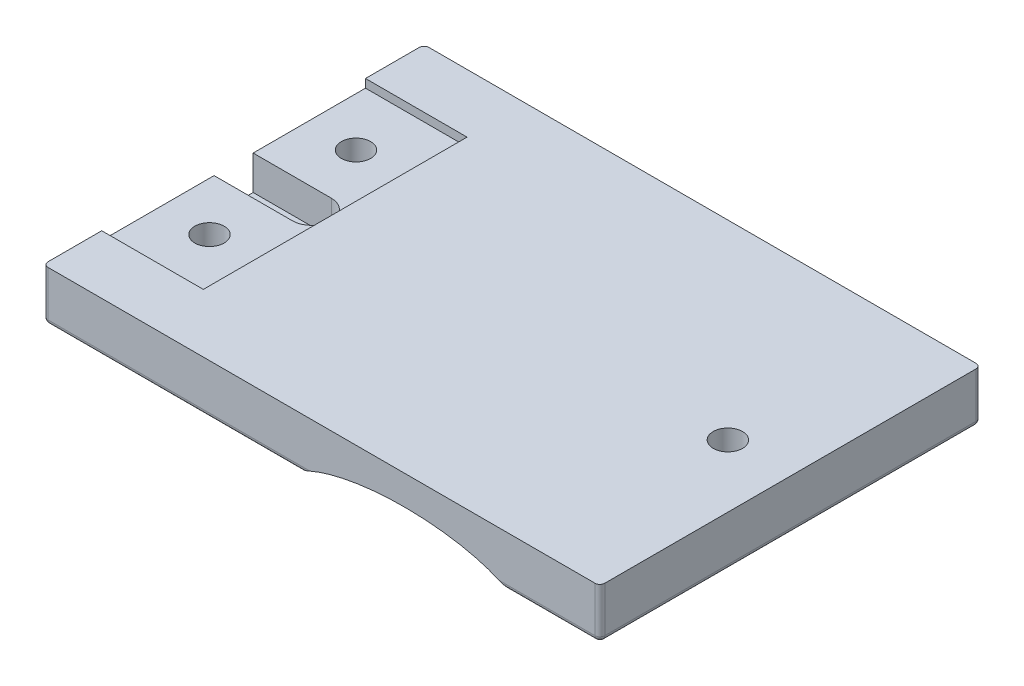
ISO-10303-21;
HEADER;
FILE_DESCRIPTION(('STEP AP214'),'2;1');
FILE_NAME('part.step','',(''),(''),'','','');
FILE_SCHEMA(('AUTOMOTIVE_DESIGN { 1 0 10303 214 1 1 1 1 }'));
ENDSEC;
DATA;
#1=APPLICATION_CONTEXT('core data for automotive mechanical design processes');
#2=APPLICATION_PROTOCOL_DEFINITION('international standard','automotive_design',2000,#1);
#3=PRODUCT_CONTEXT('',#1,'mechanical');
#4=PRODUCT('Part','Part','',(#3));
#5=PRODUCT_RELATED_PRODUCT_CATEGORY('part','',(#4));
#6=PRODUCT_DEFINITION_FORMATION('','',#4);
#7=PRODUCT_DEFINITION_CONTEXT('part definition',#1,'design');
#8=PRODUCT_DEFINITION('design','',#6,#7);
#9=PRODUCT_DEFINITION_SHAPE('','',#8);
#10=(LENGTH_UNIT() NAMED_UNIT(*) SI_UNIT(.MILLI.,.METRE.));
#11=(NAMED_UNIT(*) PLANE_ANGLE_UNIT() SI_UNIT($,.RADIAN.));
#12=(NAMED_UNIT(*) SI_UNIT($,.STERADIAN.) SOLID_ANGLE_UNIT());
#13=UNCERTAINTY_MEASURE_WITH_UNIT(LENGTH_MEASURE(1.E-05),#10,'distance_accuracy_value','');
#14=(GEOMETRIC_REPRESENTATION_CONTEXT(3) GLOBAL_UNCERTAINTY_ASSIGNED_CONTEXT((#13)) GLOBAL_UNIT_ASSIGNED_CONTEXT((#10,
#11,#12)) REPRESENTATION_CONTEXT('',''));
#15=CARTESIAN_POINT('',(0.,0.,0.));
#16=DIRECTION('',(0.,0.,1.));
#17=DIRECTION('',(1.,0.,0.));
#18=AXIS2_PLACEMENT_3D('',#15,#16,#17);
#19=CARTESIAN_POINT('',(-44.7364066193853,5.15,-7.80141843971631));
#20=DIRECTION('',(1.,0.,0.));
#21=DIRECTION('',(0.,0.,-1.));
#22=AXIS2_PLACEMENT_3D('',#19,#20,#21);
#23=PLANE('',#22);
#24=DIRECTION('',(0.,1.,0.));
#25=VECTOR('',#24,1.);
#26=CARTESIAN_POINT('',(-44.7364066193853,0.790000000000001,13.6985815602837));
#27=LINE('',#26,#25);
#28=CARTESIAN_POINT('',(-44.7364066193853,0.790000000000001,13.6985815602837));
#29=VERTEX_POINT('',#28);
#30=CARTESIAN_POINT('',(-44.7364066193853,4.29,13.6985815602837));
#31=VERTEX_POINT('',#30);
#32=EDGE_CURVE('E224',#29,#31,#27,.T.);
#33=ORIENTED_EDGE('',*,*,#32,.F.);
#34=DIRECTION('',(0.,0.,1.));
#35=VECTOR('',#34,1.);
#36=CARTESIAN_POINT('',(-44.7364066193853,0.790000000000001,0.));
#37=LINE('',#36,#35);
#38=CARTESIAN_POINT('',(-44.7364066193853,0.790000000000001,9.69858156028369));
#39=VERTEX_POINT('',#38);
#40=EDGE_CURVE('E202',#39,#29,#37,.T.);
#41=ORIENTED_EDGE('',*,*,#40,.F.);
#42=DIRECTION('',(0.,1.,0.));
#43=VECTOR('',#42,1.);
#44=CARTESIAN_POINT('',(-44.7364066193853,0.790000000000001,9.69858156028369));
#45=LINE('',#44,#43);
#46=CARTESIAN_POINT('',(-44.7364066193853,4.29,9.69858156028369));
#47=VERTEX_POINT('',#46);
#48=EDGE_CURVE('E227',#39,#47,#45,.T.);
#49=ORIENTED_EDGE('',*,*,#48,.T.);
#50=DIRECTION('',(0.,0.,1.));
#51=VECTOR('',#50,1.);
#52=CARTESIAN_POINT('',(-44.7364066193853,4.29,25.1985815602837));
#53=LINE('',#52,#51);
#54=CARTESIAN_POINT('',(-44.7364066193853,4.29,-1.80141843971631));
#55=VERTEX_POINT('',#54);
#56=EDGE_CURVE('E523',#55,#47,#53,.T.);
#57=ORIENTED_EDGE('',*,*,#56,.F.);
#58=DIRECTION('',(0.,1.,0.));
#59=VECTOR('',#58,1.);
#60=CARTESIAN_POINT('',(-44.7364066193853,4.29,-1.80141843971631));
#61=LINE('',#60,#59);
#62=CARTESIAN_POINT('',(-44.7364066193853,5.15,-1.80141843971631));
#63=VERTEX_POINT('',#62);
#64=EDGE_CURVE('E422',#55,#63,#61,.T.);
#65=ORIENTED_EDGE('',*,*,#64,.T.);
#66=DIRECTION('',(0.,0.,1.));
#67=VECTOR('',#66,1.);
#68=CARTESIAN_POINT('',(-44.7364066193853,5.15,-7.80141843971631));
#69=LINE('',#68,#67);
#70=CARTESIAN_POINT('',(-44.7364066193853,5.15,-7.30141843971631));
#71=VERTEX_POINT('',#70);
#72=EDGE_CURVE('E421',#71,#63,#69,.T.);
#73=ORIENTED_EDGE('',*,*,#72,.F.);
#74=DIRECTION('',(0.,-1.,0.));
#75=VECTOR('',#74,1.);
#76=CARTESIAN_POINT('',(-44.7364066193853,5.15,-7.30141843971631));
#77=LINE('',#76,#75);
#78=CARTESIAN_POINT('',(-44.7364066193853,0.5,-7.30141843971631));
#79=VERTEX_POINT('',#78);
#80=EDGE_CURVE('E11',#71,#79,#77,.T.);
#81=ORIENTED_EDGE('',*,*,#80,.T.);
#82=DIRECTION('',(0.,0.,1.));
#83=VECTOR('',#82,1.);
#84=CARTESIAN_POINT('',(-44.7364066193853,0.5,-7.80141843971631));
#85=LINE('',#84,#83);
#86=CARTESIAN_POINT('',(-44.7364066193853,0.5,30.6985815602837));
#87=VERTEX_POINT('',#86);
#88=EDGE_CURVE('E57',#79,#87,#85,.T.);
#89=ORIENTED_EDGE('',*,*,#88,.T.);
#90=DIRECTION('',(0.,-1.,0.));
#91=VECTOR('',#90,1.);
#92=CARTESIAN_POINT('',(-44.7364066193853,5.15,30.6985815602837));
#93=LINE('',#92,#91);
#94=CARTESIAN_POINT('',(-44.7364066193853,5.15,30.6985815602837));
#95=VERTEX_POINT('',#94);
#96=EDGE_CURVE('E42',#87,#95,#93,.F.);
#97=ORIENTED_EDGE('',*,*,#96,.T.);
#98=CARTESIAN_POINT('',(-44.7364066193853,5.15,25.1985815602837));
#99=VERTEX_POINT('',#98);
#100=EDGE_CURVE('E413',#99,#95,#69,.T.);
#101=ORIENTED_EDGE('',*,*,#100,.F.);
#102=DIRECTION('',(0.,1.,0.));
#103=VECTOR('',#102,1.);
#104=CARTESIAN_POINT('',(-44.7364066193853,4.29,25.1985815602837));
#105=LINE('',#104,#103);
#106=CARTESIAN_POINT('',(-44.7364066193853,4.29,25.1985815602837));
#107=VERTEX_POINT('',#106);
#108=EDGE_CURVE('E430',#107,#99,#105,.T.);
#109=ORIENTED_EDGE('',*,*,#108,.F.);
#110=EDGE_CURVE('E546',#31,#107,#53,.T.);
#111=ORIENTED_EDGE('',*,*,#110,.F.);
#112=EDGE_LOOP('',(#33,#41,#49,#57,#65,#73,#81,#89,#97,#101,#109,#111));
#113=FACE_BOUND('',#112,.T.);
#114=ADVANCED_FACE('F33',(#113),#23,.F.);
#115=CARTESIAN_POINT('',(0.,4.29,0.));
#116=DIRECTION('',(0.,1.,0.));
#117=DIRECTION('',(0.,0.,1.));
#118=AXIS2_PLACEMENT_3D('',#115,#116,#117);
#119=PLANE('',#118);
#120=CARTESIAN_POINT('',(-39.7364066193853,4.29,4.16772522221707));
#121=DIRECTION('',(0.,1.,0.));
#122=DIRECTION('',(0.,0.,1.));
#123=AXIS2_PLACEMENT_3D('',#120,#121,#122);
#124=CIRCLE('',#123,1.5);
#125=CARTESIAN_POINT('',(-39.7364066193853,4.29,5.66772522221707));
#126=VERTEX_POINT('',#125);
#127=EDGE_CURVE('E236',#126,#126,#124,.T.);
#128=ORIENTED_EDGE('',*,*,#127,.F.);
#129=EDGE_LOOP('',(#128));
#130=FACE_BOUND('',#129,.T.);
#131=CARTESIAN_POINT('',(-39.7364066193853,4.29,19.1677252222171));
#132=DIRECTION('',(0.,1.,0.));
#133=DIRECTION('',(0.,0.,1.));
#134=AXIS2_PLACEMENT_3D('',#131,#132,#133);
#135=CIRCLE('',#134,1.5);
#136=CARTESIAN_POINT('',(-39.7364066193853,4.29,20.6677252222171));
#137=VERTEX_POINT('',#136);
#138=EDGE_CURVE('E242',#137,#137,#135,.T.);
#139=ORIENTED_EDGE('',*,*,#138,.F.);
#140=EDGE_LOOP('',(#139));
#141=FACE_BOUND('',#140,.T.);
#142=CARTESIAN_POINT('',(-36.7364066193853,4.29,11.6985815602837));
#143=DIRECTION('',(0.,1.,0.));
#144=DIRECTION('',(0.,0.,1.));
#145=AXIS2_PLACEMENT_3D('',#142,#143,#144);
#146=CIRCLE('',#145,2.);
#147=CARTESIAN_POINT('',(-36.7364066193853,4.29,13.6985815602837));
#148=VERTEX_POINT('',#147);
#149=CARTESIAN_POINT('',(-36.7364066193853,4.29,9.69858156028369));
#150=VERTEX_POINT('',#149);
#151=EDGE_CURVE('E221',#148,#150,#146,.T.);
#152=ORIENTED_EDGE('',*,*,#151,.F.);
#153=DIRECTION('',(-1.,0.,0.));
#154=VECTOR('',#153,1.);
#155=CARTESIAN_POINT('',(0.,4.29,13.6985815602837));
#156=LINE('',#155,#154);
#157=EDGE_CURVE('E50',#148,#31,#156,.T.);
#158=ORIENTED_EDGE('',*,*,#157,.T.);
#159=ORIENTED_EDGE('',*,*,#110,.T.);
#160=DIRECTION('',(1.,0.,0.));
#161=VECTOR('',#160,1.);
#162=CARTESIAN_POINT('',(-34.3364066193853,4.29,25.1985815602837));
#163=LINE('',#162,#161);
#164=CARTESIAN_POINT('',(-34.3364066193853,4.29,25.1985815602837));
#165=VERTEX_POINT('',#164);
#166=EDGE_CURVE('E538',#107,#165,#163,.T.);
#167=ORIENTED_EDGE('',*,*,#166,.T.);
#168=DIRECTION('',(0.,0.,-1.));
#169=VECTOR('',#168,1.);
#170=CARTESIAN_POINT('',(-34.3364066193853,4.29,25.1985815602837));
#171=LINE('',#170,#169);
#172=CARTESIAN_POINT('',(-34.3364066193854,4.29,-1.80141843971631));
#173=VERTEX_POINT('',#172);
#174=EDGE_CURVE('E535',#165,#173,#171,.T.);
#175=ORIENTED_EDGE('',*,*,#174,.T.);
#176=DIRECTION('',(-1.,0.,0.));
#177=VECTOR('',#176,1.);
#178=CARTESIAN_POINT('',(-34.3364066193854,4.29,-1.80141843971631));
#179=LINE('',#178,#177);
#180=EDGE_CURVE('E528',#173,#55,#179,.T.);
#181=ORIENTED_EDGE('',*,*,#180,.T.);
#182=ORIENTED_EDGE('',*,*,#56,.T.);
#183=DIRECTION('',(-1.,0.,0.));
#184=VECTOR('',#183,1.);
#185=CARTESIAN_POINT('',(0.,4.29,9.6985815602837));
#186=LINE('',#185,#184);
#187=EDGE_CURVE('E211',#150,#47,#186,.T.);
#188=ORIENTED_EDGE('',*,*,#187,.F.);
#189=EDGE_LOOP('',(#152,#158,#159,#167,#175,#181,#182,#188));
#190=FACE_BOUND('',#189,.T.);
#191=ADVANCED_FACE('F267',(#130,#141,#190),#119,.T.);
#192=CARTESIAN_POINT('',(0.,0.,0.));
#193=DIRECTION('',(0.,1.,0.));
#194=DIRECTION('',(0.,0.,1.));
#195=AXIS2_PLACEMENT_3D('',#192,#193,#194);
#196=PLANE('',#195);
#197=CARTESIAN_POINT('',(-39.7364066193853,0.,4.16772522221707));
#198=DIRECTION('',(0.,1.,0.));
#199=DIRECTION('',(0.,0.,1.));
#200=AXIS2_PLACEMENT_3D('',#197,#198,#199);
#201=CIRCLE('',#200,1.5);
#202=CARTESIAN_POINT('',(-39.7364066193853,0.,5.66772522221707));
#203=VERTEX_POINT('',#202);
#204=EDGE_CURVE('E239',#203,#203,#201,.T.);
#205=ORIENTED_EDGE('',*,*,#204,.T.);
#206=EDGE_LOOP('',(#205));
#207=FACE_BOUND('',#206,.T.);
#208=CARTESIAN_POINT('',(-39.7364066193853,0.,19.1677252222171));
#209=DIRECTION('',(0.,1.,0.));
#210=DIRECTION('',(0.,0.,1.));
#211=AXIS2_PLACEMENT_3D('',#208,#209,#210);
#212=CIRCLE('',#211,1.5);
#213=CARTESIAN_POINT('',(-39.7364066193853,0.,20.6677252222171));
#214=VERTEX_POINT('',#213);
#215=EDGE_CURVE('E245',#214,#214,#212,.T.);
#216=ORIENTED_EDGE('',*,*,#215,.T.);
#217=EDGE_LOOP('',(#216));
#218=FACE_BOUND('',#217,.T.);
#219=DIRECTION('',(-1.,0.,0.));
#220=VECTOR('',#219,1.);
#221=CARTESIAN_POINT('',(0.,0.,-7.30141843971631));
#222=LINE('',#221,#220);
#223=CARTESIAN_POINT('',(-44.2364066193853,0.,-7.30141843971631));
#224=VERTEX_POINT('',#223);
#225=CARTESIAN_POINT('',(-18.5303618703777,0.,-7.30141843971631));
#226=VERTEX_POINT('',#225);
#227=EDGE_CURVE('E328',#224,#226,#222,.F.);
#228=ORIENTED_EDGE('',*,*,#227,.T.);
#229=DIRECTION('',(0.,0.,1.));
#230=VECTOR('',#229,1.);
#231=CARTESIAN_POINT('',(-18.5303618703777,0.,0.));
#232=LINE('',#231,#230);
#233=CARTESIAN_POINT('',(-18.5303618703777,0.,30.6985815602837));
#234=VERTEX_POINT('',#233);
#235=EDGE_CURVE('E332',#226,#234,#232,.T.);
#236=ORIENTED_EDGE('',*,*,#235,.T.);
#237=DIRECTION('',(1.,0.,0.));
#238=VECTOR('',#237,1.);
#239=CARTESIAN_POINT('',(0.,0.,30.6985815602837));
#240=LINE('',#239,#238);
#241=CARTESIAN_POINT('',(-44.2364066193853,0.,30.6985815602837));
#242=VERTEX_POINT('',#241);
#243=EDGE_CURVE('E330',#234,#242,#240,.F.);
#244=ORIENTED_EDGE('',*,*,#243,.T.);
#245=DIRECTION('',(0.,0.,1.));
#246=VECTOR('',#245,1.);
#247=CARTESIAN_POINT('',(-44.2364066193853,0.,0.));
#248=LINE('',#247,#246);
#249=EDGE_CURVE('E326',#242,#224,#248,.F.);
#250=ORIENTED_EDGE('',*,*,#249,.T.);
#251=EDGE_LOOP('',(#228,#236,#244,#250));
#252=FACE_BOUND('',#251,.T.);
#253=ADVANCED_FACE('F393',(#207,#218,#252),#196,.F.);
#254=CARTESIAN_POINT('',(-44.7364066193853,5.15,31.1985815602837));
#255=DIRECTION('',(0.,0.,-1.));
#256=DIRECTION('',(-1.,0.,0.));
#257=AXIS2_PLACEMENT_3D('',#254,#255,#256);
#258=PLANE('',#257);
#259=DIRECTION('',(1.,0.,0.));
#260=VECTOR('',#259,1.);
#261=CARTESIAN_POINT('',(-44.7364066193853,0.5,31.1985815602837));
#262=LINE('',#261,#260);
#263=CARTESIAN_POINT('',(1.93708235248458,0.5,31.1985815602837));
#264=VERTEX_POINT('',#263);
#265=CARTESIAN_POINT('',(11.7635933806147,0.5,31.1985815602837));
#266=VERTEX_POINT('',#265);
#267=EDGE_CURVE('E449',#264,#266,#262,.T.);
#268=ORIENTED_EDGE('',*,*,#267,.T.);
#269=DIRECTION('',(0.,-1.,0.));
#270=VECTOR('',#269,1.);
#271=CARTESIAN_POINT('',(11.7635933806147,5.15,31.1985815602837));
#272=LINE('',#271,#270);
#273=CARTESIAN_POINT('',(11.7635933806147,5.15,31.1985815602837));
#274=VERTEX_POINT('',#273);
#275=EDGE_CURVE('E451',#266,#274,#272,.F.);
#276=ORIENTED_EDGE('',*,*,#275,.T.);
#277=DIRECTION('',(1.,0.,0.));
#278=VECTOR('',#277,1.);
#279=CARTESIAN_POINT('',(-44.7364066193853,5.15,31.1985815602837));
#280=LINE('',#279,#278);
#281=CARTESIAN_POINT('',(-44.2364066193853,5.15,31.1985815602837));
#282=VERTEX_POINT('',#281);
#283=EDGE_CURVE('E424',#282,#274,#280,.T.);
#284=ORIENTED_EDGE('',*,*,#283,.F.);
#285=DIRECTION('',(0.,-1.,0.));
#286=VECTOR('',#285,1.);
#287=CARTESIAN_POINT('',(-44.2364066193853,5.15,31.1985815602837));
#288=LINE('',#287,#286);
#289=CARTESIAN_POINT('',(-44.2364066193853,0.5,31.1985815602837));
#290=VERTEX_POINT('',#289);
#291=EDGE_CURVE('E408',#282,#290,#288,.T.);
#292=ORIENTED_EDGE('',*,*,#291,.T.);
#293=DIRECTION('',(1.,0.,0.));
#294=VECTOR('',#293,1.);
#295=CARTESIAN_POINT('',(-44.7364066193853,0.5,31.1985815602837));
#296=LINE('',#295,#294);
#297=CARTESIAN_POINT('',(-17.4098955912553,0.5,31.1985815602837));
#298=VERTEX_POINT('',#297);
#299=EDGE_CURVE('E447',#290,#298,#296,.T.);
#300=ORIENTED_EDGE('',*,*,#299,.T.);
#301=CARTESIAN_POINT('',(-7.73640661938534,-2.35,31.1985815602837));
#302=DIRECTION('',(0.,0.,1.));
#303=DIRECTION('',(-1.,0.,0.));
#304=AXIS2_PLACEMENT_3D('',#301,#302,#303);
#305=ELLIPSE('',#304,12.5,4.5);
#306=EDGE_CURVE('E254',#264,#298,#305,.T.);
#307=ORIENTED_EDGE('',*,*,#306,.F.);
#308=EDGE_LOOP('',(#268,#276,#284,#292,#300,#307));
#309=FACE_BOUND('',#308,.T.);
#310=ADVANCED_FACE('F489',(#309),#258,.F.);
#311=CARTESIAN_POINT('',(12.2635933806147,5.15,-7.80141843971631));
#312=DIRECTION('',(-1.,0.,0.));
#313=DIRECTION('',(0.,0.,1.));
#314=AXIS2_PLACEMENT_3D('',#311,#312,#313);
#315=PLANE('',#314);
#316=DIRECTION('',(0.,0.,-1.));
#317=VECTOR('',#316,1.);
#318=CARTESIAN_POINT('',(12.2635933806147,5.15,-7.80141843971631));
#319=LINE('',#318,#317);
#320=CARTESIAN_POINT('',(12.2635933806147,5.15,30.6985815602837));
#321=VERTEX_POINT('',#320);
#322=CARTESIAN_POINT('',(12.2635933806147,5.15,-7.30141843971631));
#323=VERTEX_POINT('',#322);
#324=EDGE_CURVE('E433',#321,#323,#319,.T.);
#325=ORIENTED_EDGE('',*,*,#324,.F.);
#326=DIRECTION('',(0.,-1.,0.));
#327=VECTOR('',#326,1.);
#328=CARTESIAN_POINT('',(12.2635933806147,5.15,30.6985815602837));
#329=LINE('',#328,#327);
#330=CARTESIAN_POINT('',(12.2635933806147,0.5,30.6985815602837));
#331=VERTEX_POINT('',#330);
#332=EDGE_CURVE('E443',#321,#331,#329,.T.);
#333=ORIENTED_EDGE('',*,*,#332,.T.);
#334=DIRECTION('',(0.,0.,-1.));
#335=VECTOR('',#334,1.);
#336=CARTESIAN_POINT('',(12.2635933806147,0.5,-7.80141843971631));
#337=LINE('',#336,#335);
#338=CARTESIAN_POINT('',(12.2635933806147,0.5,-7.30141843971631));
#339=VERTEX_POINT('',#338);
#340=EDGE_CURVE('E439',#331,#339,#337,.T.);
#341=ORIENTED_EDGE('',*,*,#340,.T.);
#342=DIRECTION('',(0.,-1.,0.));
#343=VECTOR('',#342,1.);
#344=CARTESIAN_POINT('',(12.2635933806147,5.15,-7.30141843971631));
#345=LINE('',#344,#343);
#346=EDGE_CURVE('E441',#339,#323,#345,.F.);
#347=ORIENTED_EDGE('',*,*,#346,.T.);
#348=EDGE_LOOP('',(#325,#333,#341,#347));
#349=FACE_BOUND('',#348,.T.);
#350=ADVANCED_FACE('F499',(#349),#315,.F.);
#351=CARTESIAN_POINT('',(-44.7364066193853,5.15,-7.80141843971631));
#352=DIRECTION('',(0.,0.,1.));
#353=DIRECTION('',(1.,0.,0.));
#354=AXIS2_PLACEMENT_3D('',#351,#352,#353);
#355=PLANE('',#354);
#356=DIRECTION('',(-1.,0.,0.));
#357=VECTOR('',#356,1.);
#358=CARTESIAN_POINT('',(-44.7364066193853,5.15,-7.80141843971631));
#359=LINE('',#358,#357);
#360=CARTESIAN_POINT('',(11.7635933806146,5.15,-7.80141843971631));
#361=VERTEX_POINT('',#360);
#362=CARTESIAN_POINT('',(-44.2364066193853,5.15,-7.80141843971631));
#363=VERTEX_POINT('',#362);
#364=EDGE_CURVE('E436',#361,#363,#359,.T.);
#365=ORIENTED_EDGE('',*,*,#364,.F.);
#366=DIRECTION('',(0.,-1.,0.));
#367=VECTOR('',#366,1.);
#368=CARTESIAN_POINT('',(11.7635933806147,5.15,-7.80141843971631));
#369=LINE('',#368,#367);
#370=CARTESIAN_POINT('',(11.7635933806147,0.5,-7.80141843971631));
#371=VERTEX_POINT('',#370);
#372=EDGE_CURVE('E465',#361,#371,#369,.T.);
#373=ORIENTED_EDGE('',*,*,#372,.T.);
#374=DIRECTION('',(-1.,0.,0.));
#375=VECTOR('',#374,1.);
#376=CARTESIAN_POINT('',(-44.7364066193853,0.5,-7.80141843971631));
#377=LINE('',#376,#375);
#378=CARTESIAN_POINT('',(1.93708235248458,0.5,-7.80141843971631));
#379=VERTEX_POINT('',#378);
#380=EDGE_CURVE('E463',#371,#379,#377,.T.);
#381=ORIENTED_EDGE('',*,*,#380,.T.);
#382=CARTESIAN_POINT('',(-7.73640661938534,-2.35,-7.80141843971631));
#383=DIRECTION('',(0.,0.,1.));
#384=DIRECTION('',(-1.,0.,0.));
#385=AXIS2_PLACEMENT_3D('',#382,#383,#384);
#386=ELLIPSE('',#385,12.5,4.5);
#387=CARTESIAN_POINT('',(-17.4098955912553,0.5,-7.80141843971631));
#388=VERTEX_POINT('',#387);
#389=EDGE_CURVE('E249',#379,#388,#386,.T.);
#390=ORIENTED_EDGE('',*,*,#389,.T.);
#391=DIRECTION('',(-1.,0.,0.));
#392=VECTOR('',#391,1.);
#393=CARTESIAN_POINT('',(-44.7364066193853,0.5,-7.80141843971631));
#394=LINE('',#393,#392);
#395=CARTESIAN_POINT('',(-44.2364066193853,0.5,-7.80141843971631));
#396=VERTEX_POINT('',#395);
#397=EDGE_CURVE('E389',#388,#396,#394,.T.);
#398=ORIENTED_EDGE('',*,*,#397,.T.);
#399=DIRECTION('',(0.,-1.,0.));
#400=VECTOR('',#399,1.);
#401=CARTESIAN_POINT('',(-44.2364066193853,5.15,-7.80141843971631));
#402=LINE('',#401,#400);
#403=EDGE_CURVE('E460',#396,#363,#402,.F.);
#404=ORIENTED_EDGE('',*,*,#403,.T.);
#405=EDGE_LOOP('',(#365,#373,#381,#390,#398,#404));
#406=FACE_BOUND('',#405,.T.);
#407=ADVANCED_FACE('F509',(#406),#355,.F.);
#408=CARTESIAN_POINT('',(0.,5.15,0.));
#409=DIRECTION('',(0.,1.,0.));
#410=DIRECTION('',(0.,0.,1.));
#411=AXIS2_PLACEMENT_3D('',#408,#409,#410);
#412=PLANE('',#411);
#413=CARTESIAN_POINT('',(5.86359338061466,5.15,11.6985815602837));
#414=DIRECTION('',(0.,1.,0.));
#415=DIRECTION('',(0.,0.,1.));
#416=AXIS2_PLACEMENT_3D('',#413,#414,#415);
#417=CIRCLE('',#416,1.49999999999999);
#418=CARTESIAN_POINT('',(5.86359338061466,5.15,13.1985815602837));
#419=VERTEX_POINT('',#418);
#420=EDGE_CURVE('E226',#419,#419,#417,.T.);
#421=ORIENTED_EDGE('',*,*,#420,.F.);
#422=EDGE_LOOP('',(#421));
#423=FACE_BOUND('',#422,.T.);
#424=ORIENTED_EDGE('',*,*,#283,.T.);
#425=CARTESIAN_POINT('',(11.7635933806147,5.15,30.6985815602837));
#426=DIRECTION('',(0.,1.,0.));
#427=DIRECTION('',(0.,0.,1.));
#428=AXIS2_PLACEMENT_3D('',#425,#426,#427);
#429=CIRCLE('',#428,0.5);
#430=EDGE_CURVE('E458',#274,#321,#429,.T.);
#431=ORIENTED_EDGE('',*,*,#430,.T.);
#432=ORIENTED_EDGE('',*,*,#324,.T.);
#433=CARTESIAN_POINT('',(11.7635933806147,5.15,-7.30141843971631));
#434=DIRECTION('',(0.,1.,0.));
#435=DIRECTION('',(0.,0.,1.));
#436=AXIS2_PLACEMENT_3D('',#433,#434,#435);
#437=CIRCLE('',#436,0.5);
#438=EDGE_CURVE('E456',#323,#361,#437,.T.);
#439=ORIENTED_EDGE('',*,*,#438,.T.);
#440=ORIENTED_EDGE('',*,*,#364,.T.);
#441=CARTESIAN_POINT('',(-44.2364066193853,5.15,-7.30141843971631));
#442=DIRECTION('',(0.,1.,0.));
#443=DIRECTION('',(0.,0.,1.));
#444=AXIS2_PLACEMENT_3D('',#441,#442,#443);
#445=CIRCLE('',#444,0.5);
#446=EDGE_CURVE('E454',#363,#71,#445,.T.);
#447=ORIENTED_EDGE('',*,*,#446,.T.);
#448=ORIENTED_EDGE('',*,*,#72,.T.);
#449=DIRECTION('',(-1.,0.,0.));
#450=VECTOR('',#449,1.);
#451=CARTESIAN_POINT('',(-34.3364066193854,5.15,-1.80141843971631));
#452=LINE('',#451,#450);
#453=CARTESIAN_POINT('',(-34.3364066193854,5.15,-1.80141843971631));
#454=VERTEX_POINT('',#453);
#455=EDGE_CURVE('E529',#454,#63,#452,.T.);
#456=ORIENTED_EDGE('',*,*,#455,.F.);
#457=DIRECTION('',(0.,0.,-1.));
#458=VECTOR('',#457,1.);
#459=CARTESIAN_POINT('',(-34.3364066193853,5.15,25.1985815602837));
#460=LINE('',#459,#458);
#461=CARTESIAN_POINT('',(-34.3364066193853,5.15,25.1985815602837));
#462=VERTEX_POINT('',#461);
#463=EDGE_CURVE('E543',#462,#454,#460,.T.);
#464=ORIENTED_EDGE('',*,*,#463,.F.);
#465=DIRECTION('',(1.,0.,0.));
#466=VECTOR('',#465,1.);
#467=CARTESIAN_POINT('',(-34.3364066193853,5.15,25.1985815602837));
#468=LINE('',#467,#466);
#469=EDGE_CURVE('E253',#99,#462,#468,.T.);
#470=ORIENTED_EDGE('',*,*,#469,.F.);
#471=ORIENTED_EDGE('',*,*,#100,.T.);
#472=CARTESIAN_POINT('',(-44.2364066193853,5.15,30.6985815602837));
#473=DIRECTION('',(0.,1.,0.));
#474=DIRECTION('',(0.,0.,1.));
#475=AXIS2_PLACEMENT_3D('',#472,#473,#474);
#476=CIRCLE('',#475,0.5);
#477=EDGE_CURVE('E409',#95,#282,#476,.T.);
#478=ORIENTED_EDGE('',*,*,#477,.T.);
#479=EDGE_LOOP('',(#424,#431,#432,#439,#440,#447,#448,#456,#464,#470,#471,#478));
#480=FACE_BOUND('',#479,.T.);
#481=ADVANCED_FACE('F417',(#423,#480),#412,.T.);
#482=CARTESIAN_POINT('',(5.86359338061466,0.,11.6985815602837));
#483=DIRECTION('',(0.,1.,0.));
#484=DIRECTION('',(0.,0.,1.));
#485=AXIS2_PLACEMENT_3D('',#482,#483,#484);
#486=CIRCLE('',#485,1.5);
#487=CARTESIAN_POINT('',(5.86359338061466,0.,13.1985815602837));
#488=VERTEX_POINT('',#487);
#489=EDGE_CURVE('E233',#488,#488,#486,.T.);
#490=ORIENTED_EDGE('',*,*,#489,.T.);
#491=EDGE_LOOP('',(#490));
#492=FACE_BOUND('',#491,.T.);
#493=DIRECTION('',(-1.,0.,0.));
#494=VECTOR('',#493,1.);
#495=CARTESIAN_POINT('',(0.,0.,-7.30141843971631));
#496=LINE('',#495,#494);
#497=CARTESIAN_POINT('',(3.057548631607,0.,-7.30141843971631));
#498=VERTEX_POINT('',#497);
#499=CARTESIAN_POINT('',(11.7635933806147,0.,-7.30141843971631));
#500=VERTEX_POINT('',#499);
#501=EDGE_CURVE('E471',#498,#500,#496,.F.);
#502=ORIENTED_EDGE('',*,*,#501,.T.);
#503=DIRECTION('',(0.,0.,-1.));
#504=VECTOR('',#503,1.);
#505=CARTESIAN_POINT('',(11.7635933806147,0.,0.));
#506=LINE('',#505,#504);
#507=CARTESIAN_POINT('',(11.7635933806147,0.,30.6985815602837));
#508=VERTEX_POINT('',#507);
#509=EDGE_CURVE('E472',#500,#508,#506,.F.);
#510=ORIENTED_EDGE('',*,*,#509,.T.);
#511=DIRECTION('',(1.,0.,0.));
#512=VECTOR('',#511,1.);
#513=CARTESIAN_POINT('',(0.,0.,30.6985815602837));
#514=LINE('',#513,#512);
#515=CARTESIAN_POINT('',(3.057548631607,0.,30.6985815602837));
#516=VERTEX_POINT('',#515);
#517=EDGE_CURVE('E467',#508,#516,#514,.F.);
#518=ORIENTED_EDGE('',*,*,#517,.T.);
#519=DIRECTION('',(0.,0.,1.));
#520=VECTOR('',#519,1.);
#521=CARTESIAN_POINT('',(3.057548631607,0.,0.));
#522=LINE('',#521,#520);
#523=EDGE_CURVE('E469',#516,#498,#522,.F.);
#524=ORIENTED_EDGE('',*,*,#523,.T.);
#525=EDGE_LOOP('',(#502,#510,#518,#524));
#526=FACE_BOUND('',#525,.T.);
#527=ADVANCED_FACE('F586',(#492,#526),#196,.F.);
#528=CARTESIAN_POINT('',(-34.3364066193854,4.29,-1.80141843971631));
#529=DIRECTION('',(0.,0.,-1.));
#530=DIRECTION('',(-1.,0.,0.));
#531=AXIS2_PLACEMENT_3D('',#528,#529,#530);
#532=PLANE('',#531);
#533=ORIENTED_EDGE('',*,*,#455,.T.);
#534=ORIENTED_EDGE('',*,*,#64,.F.);
#535=ORIENTED_EDGE('',*,*,#180,.F.);
#536=DIRECTION('',(0.,1.,0.));
#537=VECTOR('',#536,1.);
#538=CARTESIAN_POINT('',(-34.3364066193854,4.29,-1.80141843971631));
#539=LINE('',#538,#537);
#540=EDGE_CURVE('E426',#173,#454,#539,.T.);
#541=ORIENTED_EDGE('',*,*,#540,.T.);
#542=EDGE_LOOP('',(#533,#534,#535,#541));
#543=FACE_BOUND('',#542,.T.);
#544=ADVANCED_FACE('F527',(#543),#532,.F.);
#545=CARTESIAN_POINT('',(-34.3364066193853,4.29,25.1985815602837));
#546=DIRECTION('',(1.,0.,0.));
#547=DIRECTION('',(0.,0.,-1.));
#548=AXIS2_PLACEMENT_3D('',#545,#546,#547);
#549=PLANE('',#548);
#550=ORIENTED_EDGE('',*,*,#463,.T.);
#551=ORIENTED_EDGE('',*,*,#540,.F.);
#552=ORIENTED_EDGE('',*,*,#174,.F.);
#553=DIRECTION('',(0.,1.,0.));
#554=VECTOR('',#553,1.);
#555=CARTESIAN_POINT('',(-34.3364066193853,4.29,25.1985815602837));
#556=LINE('',#555,#554);
#557=EDGE_CURVE('E537',#165,#462,#556,.T.);
#558=ORIENTED_EDGE('',*,*,#557,.T.);
#559=EDGE_LOOP('',(#550,#551,#552,#558));
#560=FACE_BOUND('',#559,.T.);
#561=ADVANCED_FACE('F549',(#560),#549,.F.);
#562=CARTESIAN_POINT('',(-34.3364066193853,4.29,25.1985815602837));
#563=DIRECTION('',(0.,0.,1.));
#564=DIRECTION('',(1.,0.,0.));
#565=AXIS2_PLACEMENT_3D('',#562,#563,#564);
#566=PLANE('',#565);
#567=ORIENTED_EDGE('',*,*,#469,.T.);
#568=ORIENTED_EDGE('',*,*,#557,.F.);
#569=ORIENTED_EDGE('',*,*,#166,.F.);
#570=ORIENTED_EDGE('',*,*,#108,.T.);
#571=EDGE_LOOP('',(#567,#568,#569,#570));
#572=FACE_BOUND('',#571,.T.);
#573=ADVANCED_FACE('F263',(#572),#566,.F.);
#574=DIRECTION('',(0.,0.,1.));
#575=VECTOR('',#574,1.);
#576=SURFACE_OF_LINEAR_EXTRUSION('',#386,#575);
#577=ORIENTED_EDGE('',*,*,#389,.F.);
#578=CARTESIAN_POINT('',(1.93708235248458,0.5,-7.80141843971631));
#579=CARTESIAN_POINT('',(1.96841537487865,0.486217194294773,-7.8014137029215));
#580=CARTESIAN_POINT('',(1.99969026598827,0.472292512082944,-7.80084814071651));
#581=CARTESIAN_POINT('',(2.06219005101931,0.444119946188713,-7.79848918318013));
#582=CARTESIAN_POINT('',(2.09341430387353,0.429871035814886,-7.79669113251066));
#583=CARTESIAN_POINT('',(2.15568694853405,0.40109389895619,-7.79175578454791));
#584=CARTESIAN_POINT('',(2.18673500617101,0.386565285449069,-7.78861648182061));
#585=CARTESIAN_POINT('',(2.24985991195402,0.356647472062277,-7.7806885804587));
#586=CARTESIAN_POINT('',(2.28192387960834,0.341248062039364,-7.77583511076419));
#587=CARTESIAN_POINT('',(2.34559007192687,0.310256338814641,-7.76431218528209));
#588=CARTESIAN_POINT('',(2.37719279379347,0.294664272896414,-7.75764486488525));
#589=CARTESIAN_POINT('',(2.43977903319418,0.263364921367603,-7.74222145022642));
#590=CARTESIAN_POINT('',(2.47076315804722,0.247657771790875,-7.73346752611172));
#591=CARTESIAN_POINT('',(2.54541156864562,0.209295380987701,-7.7091137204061));
#592=CARTESIAN_POINT('',(2.58866706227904,0.186618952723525,-7.69219576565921));
#593=CARTESIAN_POINT('',(2.65115547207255,0.153228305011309,-7.66193072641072));
#594=CARTESIAN_POINT('',(2.67147859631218,0.142261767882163,-7.65110169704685));
#595=CARTESIAN_POINT('',(2.71115732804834,0.120651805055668,-7.62753367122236));
#596=CARTESIAN_POINT('',(2.7305139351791,0.110008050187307,-7.61479670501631));
#597=CARTESIAN_POINT('',(2.76004407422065,0.0936263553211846,-7.59289946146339));
#598=CARTESIAN_POINT('',(2.77066393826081,0.0877032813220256,-7.58447980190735));
#599=CARTESIAN_POINT('',(2.79138536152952,0.076089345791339,-7.56677044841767));
#600=CARTESIAN_POINT('',(2.80148430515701,0.0703996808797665,-7.55747692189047));
#601=CARTESIAN_POINT('',(2.81124080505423,0.064876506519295,-7.54772626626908));
#602=B_SPLINE_CURVE_WITH_KNOTS('',3,(#578,#579,#580,#581,#582,#583,#584,#585,#586,#587,#588,
#589,#590,#591,#592,#593,#594,#595,#596,#597,#598,#599,#600,#601),.UNSPECIFIED.,.F.,.F.,(4,2,2,
2,2,2,2,2,2,2,2,4),(0.,0.102692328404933,0.205774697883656,0.309011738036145,0.416669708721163,
0.524201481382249,0.631621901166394,0.786230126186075,0.862682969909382,0.939055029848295,
0.983393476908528,1.02793636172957),.UNSPECIFIED.);
#603=CARTESIAN_POINT('',(2.81124080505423,0.064876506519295,-7.54772626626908));
#604=VERTEX_POINT('',#603);
#605=EDGE_CURVE('E321',#379,#604,#602,.T.);
#606=ORIENTED_EDGE('',*,*,#605,.T.);
#607=DIRECTION('',(0.,0.,1.));
#608=VECTOR('',#607,1.);
#609=CARTESIAN_POINT('',(2.81124080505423,0.064876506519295,-7.80141843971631));
#610=LINE('',#609,#608);
#611=CARTESIAN_POINT('',(2.81124080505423,0.064876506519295,30.9448893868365));
#612=VERTEX_POINT('',#611);
#613=EDGE_CURVE('E294',#604,#612,#610,.T.);
#614=ORIENTED_EDGE('',*,*,#613,.T.);
#615=CARTESIAN_POINT('',(2.81124080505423,0.064876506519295,30.9448893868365));
#616=CARTESIAN_POINT('',(2.7971387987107,0.0728608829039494,30.9589653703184));
#617=CARTESIAN_POINT('',(2.78234384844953,0.0811785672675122,30.9720944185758));
#618=CARTESIAN_POINT('',(2.75171433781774,0.0982672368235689,30.9966374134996));
#619=CARTESIAN_POINT('',(2.73588304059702,0.10703678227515,31.0080564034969));
#620=CARTESIAN_POINT('',(2.70362182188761,0.124765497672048,31.029319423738));
#621=CARTESIAN_POINT('',(2.68720068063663,0.133721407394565,31.0391797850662));
#622=CARTESIAN_POINT('',(2.65375276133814,0.151818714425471,31.0576597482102));
#623=CARTESIAN_POINT('',(2.63672540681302,0.160960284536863,31.0662781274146));
#624=CARTESIAN_POINT('',(2.58706082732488,0.187409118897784,31.0894984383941));
#625=CARTESIAN_POINT('',(2.55384002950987,0.204841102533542,31.10271286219));
#626=CARTESIAN_POINT('',(2.48633867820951,0.239723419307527,31.1260098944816));
#627=CARTESIAN_POINT('',(2.45205756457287,0.257173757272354,31.1360908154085));
#628=CARTESIAN_POINT('',(2.38242370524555,0.292087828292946,31.1537284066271));
#629=CARTESIAN_POINT('',(2.3470637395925,0.309550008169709,31.161259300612));
#630=CARTESIAN_POINT('',(2.2758060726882,0.344214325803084,31.1740513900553));
#631=CARTESIAN_POINT('',(2.23990822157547,0.361416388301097,31.179311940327));
#632=CARTESIAN_POINT('',(2.15950142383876,0.399380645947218,31.1888293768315));
#633=CARTESIAN_POINT('',(2.11489508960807,0.420060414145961,31.1925840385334));
#634=CARTESIAN_POINT('',(2.02591778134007,0.460586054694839,31.1974310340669));
#635=CARTESIAN_POINT('',(1.98155233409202,0.480439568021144,31.198560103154));
#636=CARTESIAN_POINT('',(1.93708235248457,0.500000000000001,31.1985815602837));
#637=B_SPLINE_CURVE_WITH_KNOTS('',3,(#615,#616,#617,#618,#619,#620,#621,#622,#623,#624,#625,
#626,#627,#628,#629,#630,#631,#632,#633,#634,#635,#636),.UNSPECIFIED.,.F.,.F.,(4,2,2,2,2,2,2,2,
2,2,4),(0.,0.0643005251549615,0.128407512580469,0.191790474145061,0.255235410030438,
0.374366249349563,0.493561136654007,0.613927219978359,0.734327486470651,0.882176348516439,
1.02794384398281),.UNSPECIFIED.);
#638=EDGE_CURVE('E288',#612,#264,#637,.T.);
#639=ORIENTED_EDGE('',*,*,#638,.T.);
#640=ORIENTED_EDGE('',*,*,#306,.T.);
#641=CARTESIAN_POINT('',(-17.4098955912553,0.5,31.1985815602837));
#642=CARTESIAN_POINT('',(-17.4412286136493,0.486217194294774,31.1985768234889));
#643=CARTESIAN_POINT('',(-17.472503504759,0.472292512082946,31.1980112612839));
#644=CARTESIAN_POINT('',(-17.53500328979,0.444119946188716,31.1956523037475));
#645=CARTESIAN_POINT('',(-17.5662275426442,0.429871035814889,31.193854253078));
#646=CARTESIAN_POINT('',(-17.6285001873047,0.401093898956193,31.1889189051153));
#647=CARTESIAN_POINT('',(-17.6595482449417,0.386565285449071,31.185779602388));
#648=CARTESIAN_POINT('',(-17.7226731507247,0.35664747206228,31.1778517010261));
#649=CARTESIAN_POINT('',(-17.754737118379,0.341248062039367,31.1729982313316));
#650=CARTESIAN_POINT('',(-17.8184033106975,0.310256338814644,31.1614753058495));
#651=CARTESIAN_POINT('',(-17.8500060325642,0.294664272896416,31.1548079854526));
#652=CARTESIAN_POINT('',(-17.9125922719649,0.263364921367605,31.1393845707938));
#653=CARTESIAN_POINT('',(-17.9435763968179,0.247657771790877,31.1306306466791));
#654=CARTESIAN_POINT('',(-18.0182248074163,0.209295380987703,31.1062768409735));
#655=CARTESIAN_POINT('',(-18.0614803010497,0.186618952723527,31.0893588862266));
#656=CARTESIAN_POINT('',(-18.1239687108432,0.153228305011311,31.0590938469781));
#657=CARTESIAN_POINT('',(-18.1442918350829,0.142261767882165,31.0482648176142));
#658=CARTESIAN_POINT('',(-18.183970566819,0.12065180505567,31.0246967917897));
#659=CARTESIAN_POINT('',(-18.2033271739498,0.110008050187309,31.0119598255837));
#660=CARTESIAN_POINT('',(-18.2328573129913,0.0936263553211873,30.9900625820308));
#661=CARTESIAN_POINT('',(-18.2434771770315,0.0877032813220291,30.9816429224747));
#662=CARTESIAN_POINT('',(-18.2641986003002,0.076089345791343,30.9639335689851));
#663=CARTESIAN_POINT('',(-18.2742975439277,0.0703996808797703,30.9546400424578));
#664=CARTESIAN_POINT('',(-18.2840540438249,0.0648765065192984,30.9448893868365));
#665=B_SPLINE_CURVE_WITH_KNOTS('',3,(#641,#642,#643,#644,#645,#646,#647,#648,#649,#650,#651,
#652,#653,#654,#655,#656,#657,#658,#659,#660,#661,#662,#663,#664),.UNSPECIFIED.,.F.,.F.,(4,2,2,
2,2,2,2,2,2,2,2,4),(0.,0.102692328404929,0.205774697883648,0.309011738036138,0.416669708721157,
0.524201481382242,0.631621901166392,0.78623012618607,0.862682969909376,0.939055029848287,
0.983393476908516,1.02793636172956),.UNSPECIFIED.);
#666=CARTESIAN_POINT('',(-18.2840540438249,0.0648765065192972,30.9448893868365));
#667=VERTEX_POINT('',#666);
#668=EDGE_CURVE('E282',#298,#667,#665,.T.);
#669=ORIENTED_EDGE('',*,*,#668,.T.);
#670=DIRECTION('',(0.,0.,1.));
#671=VECTOR('',#670,1.);
#672=CARTESIAN_POINT('',(-18.2840540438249,0.0648765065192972,31.1985815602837));
#673=LINE('',#672,#671);
#674=CARTESIAN_POINT('',(-18.2840540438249,0.0648765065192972,-7.54772626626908));
#675=VERTEX_POINT('',#674);
#676=EDGE_CURVE('E476',#667,#675,#673,.F.);
#677=ORIENTED_EDGE('',*,*,#676,.T.);
#678=CARTESIAN_POINT('',(-18.2840540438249,0.0648765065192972,-7.54772626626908));
#679=CARTESIAN_POINT('',(-18.2699520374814,0.0728608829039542,-7.56180224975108));
#680=CARTESIAN_POINT('',(-18.2551570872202,0.0811785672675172,-7.57493129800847));
#681=CARTESIAN_POINT('',(-18.2245275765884,0.0982672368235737,-7.5994742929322));
#682=CARTESIAN_POINT('',(-18.2086962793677,0.107036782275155,-7.61089328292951));
#683=CARTESIAN_POINT('',(-18.1764350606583,0.124765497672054,-7.63215630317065));
#684=CARTESIAN_POINT('',(-18.1600139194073,0.133721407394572,-7.64201666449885));
#685=CARTESIAN_POINT('',(-18.1265660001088,0.151818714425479,-7.66049662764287));
#686=CARTESIAN_POINT('',(-18.1095386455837,0.160960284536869,-7.66911500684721));
#687=CARTESIAN_POINT('',(-18.0598740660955,0.187409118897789,-7.69233531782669));
#688=CARTESIAN_POINT('',(-18.0266532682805,0.204841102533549,-7.70554974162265));
#689=CARTESIAN_POINT('',(-17.9591519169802,0.239723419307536,-7.72884677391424));
#690=CARTESIAN_POINT('',(-17.9248708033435,0.257173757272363,-7.7389276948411));
#691=CARTESIAN_POINT('',(-17.8552369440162,0.292087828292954,-7.75656528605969));
#692=CARTESIAN_POINT('',(-17.8198769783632,0.309550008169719,-7.76409618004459));
#693=CARTESIAN_POINT('',(-17.7486193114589,0.344214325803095,-7.77688826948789));
#694=CARTESIAN_POINT('',(-17.7127214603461,0.361416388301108,-7.78214881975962));
#695=CARTESIAN_POINT('',(-17.6323146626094,0.399380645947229,-7.79166625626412));
#696=CARTESIAN_POINT('',(-17.5877083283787,0.42006041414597,-7.79542091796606));
#697=CARTESIAN_POINT('',(-17.4987310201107,0.460586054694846,-7.80026791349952));
#698=CARTESIAN_POINT('',(-17.4543655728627,0.480439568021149,-7.80139698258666));
#699=CARTESIAN_POINT('',(-17.4098955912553,0.500000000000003,-7.80141843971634));
#700=B_SPLINE_CURVE_WITH_KNOTS('',3,(#678,#679,#680,#681,#682,#683,#684,#685,#686,#687,#688,
#689,#690,#691,#692,#693,#694,#695,#696,#697,#698,#699),.UNSPECIFIED.,.F.,.F.,(4,2,2,2,2,2,2,2,
2,2,4),(0.,0.0643005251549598,0.12840751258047,0.191790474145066,0.255235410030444,
0.374366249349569,0.493561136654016,0.613927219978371,0.734327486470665,0.882176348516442,
1.0279438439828),.UNSPECIFIED.);
#701=EDGE_CURVE('E272',#675,#388,#700,.T.);
#702=ORIENTED_EDGE('',*,*,#701,.T.);
#703=EDGE_LOOP('',(#577,#606,#614,#639,#640,#669,#677,#702));
#704=FACE_BOUND('',#703,.T.);
#705=ADVANCED_FACE('F257',(#704),#576,.F.);
#706=CARTESIAN_POINT('',(11.7635933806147,5.15,-7.30141843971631));
#707=DIRECTION('',(0.,-1.,0.));
#708=DIRECTION('',(0.,0.,-1.));
#709=AXIS2_PLACEMENT_3D('',#706,#707,#708);
#710=CYLINDRICAL_SURFACE('',#709,0.5);
#711=ORIENTED_EDGE('',*,*,#438,.F.);
#712=ORIENTED_EDGE('',*,*,#346,.F.);
#713=CARTESIAN_POINT('',(11.7635933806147,0.5,-7.30141843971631));
#714=DIRECTION('',(0.,-1.,0.));
#715=DIRECTION('',(0.,0.,-1.));
#716=AXIS2_PLACEMENT_3D('',#713,#714,#715);
#717=CIRCLE('',#716,0.5);
#718=EDGE_CURVE('E356',#371,#339,#717,.T.);
#719=ORIENTED_EDGE('',*,*,#718,.F.);
#720=ORIENTED_EDGE('',*,*,#372,.F.);
#721=EDGE_LOOP('',(#711,#712,#719,#720));
#722=FACE_BOUND('',#721,.T.);
#723=ADVANCED_FACE('F262',(#722),#710,.T.);
#724=CARTESIAN_POINT('',(-44.7364066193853,0.5,-7.30141843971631));
#725=DIRECTION('',(-1.,0.,0.));
#726=DIRECTION('',(0.,0.,1.));
#727=AXIS2_PLACEMENT_3D('',#724,#725,#726);
#728=CYLINDRICAL_SURFACE('',#727,0.5);
#729=ORIENTED_EDGE('',*,*,#605,.F.);
#730=ORIENTED_EDGE('',*,*,#380,.F.);
#731=CARTESIAN_POINT('',(11.7635933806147,0.5,-7.30141843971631));
#732=DIRECTION('',(1.,0.,0.));
#733=DIRECTION('',(0.,0.,-1.));
#734=AXIS2_PLACEMENT_3D('',#731,#732,#733);
#735=CIRCLE('',#734,0.5);
#736=EDGE_CURVE('E353',#500,#371,#735,.T.);
#737=ORIENTED_EDGE('',*,*,#736,.F.);
#738=ORIENTED_EDGE('',*,*,#501,.F.);
#739=CARTESIAN_POINT('',(3.057548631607,0.499999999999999,-7.30141843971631));
#740=DIRECTION('',(-0.707106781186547,0.,0.707106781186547));
#741=DIRECTION('',(0.707106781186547,0.,0.707106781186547));
#742=AXIS2_PLACEMENT_3D('',#739,#740,#741);
#743=ELLIPSE('',#742,0.707106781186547,0.5);
#744=EDGE_CURVE('E350',#604,#498,#743,.T.);
#745=ORIENTED_EDGE('',*,*,#744,.F.);
#746=EDGE_LOOP('',(#729,#730,#737,#738,#745));
#747=FACE_BOUND('',#746,.T.);
#748=ADVANCED_FACE('F314',(#747),#728,.T.);
#749=CARTESIAN_POINT('',(11.7635933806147,0.5,-7.30141843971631));
#750=DIRECTION('',(0.,0.,1.));
#751=DIRECTION('',(1.,0.,0.));
#752=AXIS2_PLACEMENT_3D('',#749,#750,#751);
#753=SPHERICAL_SURFACE('',#752,0.5);
#754=ORIENTED_EDGE('',*,*,#736,.T.);
#755=ORIENTED_EDGE('',*,*,#718,.T.);
#756=CARTESIAN_POINT('',(11.7635933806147,0.5,-7.30141843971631));
#757=DIRECTION('',(0.,0.,-1.));
#758=DIRECTION('',(-1.,0.,0.));
#759=AXIS2_PLACEMENT_3D('',#756,#757,#758);
#760=CIRCLE('',#759,0.5);
#761=EDGE_CURVE('E347',#500,#339,#760,.F.);
#762=ORIENTED_EDGE('',*,*,#761,.F.);
#763=EDGE_LOOP('',(#754,#755,#762));
#764=FACE_BOUND('',#763,.T.);
#765=ADVANCED_FACE('F310',(#764),#753,.T.);
#766=CARTESIAN_POINT('',(3.057548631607,0.499999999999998,11.6985815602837));
#767=DIRECTION('',(0.,0.,1.));
#768=DIRECTION('',(1.,0.,0.));
#769=AXIS2_PLACEMENT_3D('',#766,#767,#768);
#770=CYLINDRICAL_SURFACE('',#769,0.5);
#771=ORIENTED_EDGE('',*,*,#744,.T.);
#772=ORIENTED_EDGE('',*,*,#523,.F.);
#773=CARTESIAN_POINT('',(3.057548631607,0.499999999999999,30.6985815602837));
#774=DIRECTION('',(0.707106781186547,0.,0.707106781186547));
#775=DIRECTION('',(0.707106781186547,0.,-0.707106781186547));
#776=AXIS2_PLACEMENT_3D('',#773,#774,#775);
#777=ELLIPSE('',#776,0.707106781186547,0.5);
#778=EDGE_CURVE('E344',#612,#516,#777,.T.);
#779=ORIENTED_EDGE('',*,*,#778,.F.);
#780=ORIENTED_EDGE('',*,*,#613,.F.);
#781=EDGE_LOOP('',(#771,#772,#779,#780));
#782=FACE_BOUND('',#781,.T.);
#783=ADVANCED_FACE('F306',(#782),#770,.T.);
#784=CARTESIAN_POINT('',(11.7635933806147,0.5,-7.80141843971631));
#785=DIRECTION('',(0.,0.,-1.));
#786=DIRECTION('',(-1.,0.,0.));
#787=AXIS2_PLACEMENT_3D('',#784,#785,#786);
#788=CYLINDRICAL_SURFACE('',#787,0.5);
#789=ORIENTED_EDGE('',*,*,#761,.T.);
#790=ORIENTED_EDGE('',*,*,#340,.F.);
#791=CARTESIAN_POINT('',(11.7635933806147,0.5,30.6985815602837));
#792=DIRECTION('',(0.,0.,1.));
#793=DIRECTION('',(1.,0.,0.));
#794=AXIS2_PLACEMENT_3D('',#791,#792,#793);
#795=CIRCLE('',#794,0.5);
#796=EDGE_CURVE('E341',#508,#331,#795,.T.);
#797=ORIENTED_EDGE('',*,*,#796,.F.);
#798=ORIENTED_EDGE('',*,*,#509,.F.);
#799=EDGE_LOOP('',(#789,#790,#797,#798));
#800=FACE_BOUND('',#799,.T.);
#801=ADVANCED_FACE('F301',(#800),#788,.T.);
#802=CARTESIAN_POINT('',(-44.7364066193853,0.5,30.6985815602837));
#803=DIRECTION('',(1.,0.,0.));
#804=DIRECTION('',(0.,0.,-1.));
#805=AXIS2_PLACEMENT_3D('',#802,#803,#804);
#806=CYLINDRICAL_SURFACE('',#805,0.5);
#807=ORIENTED_EDGE('',*,*,#778,.T.);
#808=ORIENTED_EDGE('',*,*,#517,.F.);
#809=CARTESIAN_POINT('',(11.7635933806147,0.5,30.6985815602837));
#810=DIRECTION('',(1.,0.,0.));
#811=DIRECTION('',(0.,0.,-1.));
#812=AXIS2_PLACEMENT_3D('',#809,#810,#811);
#813=CIRCLE('',#812,0.5);
#814=EDGE_CURVE('E339',#266,#508,#813,.T.);
#815=ORIENTED_EDGE('',*,*,#814,.F.);
#816=ORIENTED_EDGE('',*,*,#267,.F.);
#817=ORIENTED_EDGE('',*,*,#638,.F.);
#818=EDGE_LOOP('',(#807,#808,#815,#816,#817));
#819=FACE_BOUND('',#818,.T.);
#820=ADVANCED_FACE('F295',(#819),#806,.T.);
#821=CARTESIAN_POINT('',(11.7635933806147,0.5,30.6985815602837));
#822=DIRECTION('',(0.,0.,1.));
#823=DIRECTION('',(1.,0.,0.));
#824=AXIS2_PLACEMENT_3D('',#821,#822,#823);
#825=SPHERICAL_SURFACE('',#824,0.5);
#826=ORIENTED_EDGE('',*,*,#814,.T.);
#827=ORIENTED_EDGE('',*,*,#796,.T.);
#828=CARTESIAN_POINT('',(11.7635933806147,0.5,30.6985815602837));
#829=DIRECTION('',(0.,-1.,0.));
#830=DIRECTION('',(0.,0.,-1.));
#831=AXIS2_PLACEMENT_3D('',#828,#829,#830);
#832=CIRCLE('',#831,0.5);
#833=EDGE_CURVE('E337',#266,#331,#832,.F.);
#834=ORIENTED_EDGE('',*,*,#833,.F.);
#835=EDGE_LOOP('',(#826,#827,#834));
#836=FACE_BOUND('',#835,.T.);
#837=ADVANCED_FACE('F300',(#836),#825,.T.);
#838=CARTESIAN_POINT('',(11.7635933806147,5.15,30.6985815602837));
#839=DIRECTION('',(0.,-1.,0.));
#840=DIRECTION('',(0.,0.,-1.));
#841=AXIS2_PLACEMENT_3D('',#838,#839,#840);
#842=CYLINDRICAL_SURFACE('',#841,0.5);
#843=ORIENTED_EDGE('',*,*,#430,.F.);
#844=ORIENTED_EDGE('',*,*,#275,.F.);
#845=ORIENTED_EDGE('',*,*,#833,.T.);
#846=ORIENTED_EDGE('',*,*,#332,.F.);
#847=EDGE_LOOP('',(#843,#844,#845,#846));
#848=FACE_BOUND('',#847,.T.);
#849=ADVANCED_FACE('F496',(#848),#842,.T.);
#850=CARTESIAN_POINT('',(-44.2364066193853,5.15,-7.30141843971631));
#851=DIRECTION('',(0.,-1.,0.));
#852=DIRECTION('',(0.,0.,-1.));
#853=AXIS2_PLACEMENT_3D('',#850,#851,#852);
#854=CYLINDRICAL_SURFACE('',#853,0.5);
#855=ORIENTED_EDGE('',*,*,#446,.F.);
#856=ORIENTED_EDGE('',*,*,#403,.F.);
#857=CARTESIAN_POINT('',(-44.2364066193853,0.5,-7.30141843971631));
#858=DIRECTION('',(0.,-1.,0.));
#859=DIRECTION('',(0.,0.,-1.));
#860=AXIS2_PLACEMENT_3D('',#857,#858,#859);
#861=CIRCLE('',#860,0.5);
#862=EDGE_CURVE('E37',#79,#396,#861,.T.);
#863=ORIENTED_EDGE('',*,*,#862,.F.);
#864=ORIENTED_EDGE('',*,*,#80,.F.);
#865=EDGE_LOOP('',(#855,#856,#863,#864));
#866=FACE_BOUND('',#865,.T.);
#867=ADVANCED_FACE('F35',(#866),#854,.T.);
#868=CARTESIAN_POINT('',(-44.2364066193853,0.5,-7.80141843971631));
#869=DIRECTION('',(0.,0.,1.));
#870=DIRECTION('',(1.,0.,0.));
#871=AXIS2_PLACEMENT_3D('',#868,#869,#870);
#872=CYLINDRICAL_SURFACE('',#871,0.5);
#873=CARTESIAN_POINT('',(-44.2364066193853,0.5,30.6985815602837));
#874=DIRECTION('',(0.,0.,1.));
#875=DIRECTION('',(1.,0.,0.));
#876=AXIS2_PLACEMENT_3D('',#873,#874,#875);
#877=CIRCLE('',#876,0.5);
#878=EDGE_CURVE('E371',#87,#242,#877,.T.);
#879=ORIENTED_EDGE('',*,*,#878,.F.);
#880=ORIENTED_EDGE('',*,*,#88,.F.);
#881=CARTESIAN_POINT('',(-44.2364066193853,0.5,-7.30141843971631));
#882=DIRECTION('',(0.,0.,-1.));
#883=DIRECTION('',(-1.,0.,0.));
#884=AXIS2_PLACEMENT_3D('',#881,#882,#883);
#885=CIRCLE('',#884,0.5);
#886=EDGE_CURVE('E373',#224,#79,#885,.T.);
#887=ORIENTED_EDGE('',*,*,#886,.F.);
#888=ORIENTED_EDGE('',*,*,#249,.F.);
#889=EDGE_LOOP('',(#879,#880,#887,#888));
#890=FACE_BOUND('',#889,.T.);
#891=ADVANCED_FACE('F398',(#890),#872,.T.);
#892=CARTESIAN_POINT('',(-44.2364066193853,5.15,30.6985815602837));
#893=DIRECTION('',(0.,-1.,0.));
#894=DIRECTION('',(0.,0.,-1.));
#895=AXIS2_PLACEMENT_3D('',#892,#893,#894);
#896=CYLINDRICAL_SURFACE('',#895,0.5);
#897=ORIENTED_EDGE('',*,*,#477,.F.);
#898=ORIENTED_EDGE('',*,*,#96,.F.);
#899=CARTESIAN_POINT('',(-44.2364066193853,0.5,30.6985815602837));
#900=DIRECTION('',(0.,-1.,0.));
#901=DIRECTION('',(0.,0.,-1.));
#902=AXIS2_PLACEMENT_3D('',#899,#900,#901);
#903=CIRCLE('',#902,0.5);
#904=EDGE_CURVE('E368',#290,#87,#903,.T.);
#905=ORIENTED_EDGE('',*,*,#904,.F.);
#906=ORIENTED_EDGE('',*,*,#291,.F.);
#907=EDGE_LOOP('',(#897,#898,#905,#906));
#908=FACE_BOUND('',#907,.T.);
#909=ADVANCED_FACE('F407',(#908),#896,.T.);
#910=CARTESIAN_POINT('',(-44.2364066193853,0.5,-7.30141843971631));
#911=DIRECTION('',(0.,0.,1.));
#912=DIRECTION('',(1.,0.,0.));
#913=AXIS2_PLACEMENT_3D('',#910,#911,#912);
#914=SPHERICAL_SURFACE('',#913,0.5);
#915=ORIENTED_EDGE('',*,*,#886,.T.);
#916=ORIENTED_EDGE('',*,*,#862,.T.);
#917=CARTESIAN_POINT('',(-44.2364066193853,0.5,-7.30141843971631));
#918=DIRECTION('',(-1.,0.,0.));
#919=DIRECTION('',(0.,0.,1.));
#920=AXIS2_PLACEMENT_3D('',#917,#918,#919);
#921=CIRCLE('',#920,0.5);
#922=EDGE_CURVE('E365',#224,#396,#921,.F.);
#923=ORIENTED_EDGE('',*,*,#922,.F.);
#924=EDGE_LOOP('',(#915,#916,#923));
#925=FACE_BOUND('',#924,.T.);
#926=ADVANCED_FACE('F380',(#925),#914,.T.);
#927=CARTESIAN_POINT('',(-44.2364066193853,0.5,30.6985815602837));
#928=DIRECTION('',(0.,0.,1.));
#929=DIRECTION('',(1.,0.,0.));
#930=AXIS2_PLACEMENT_3D('',#927,#928,#929);
#931=SPHERICAL_SURFACE('',#930,0.5);
#932=ORIENTED_EDGE('',*,*,#904,.T.);
#933=ORIENTED_EDGE('',*,*,#878,.T.);
#934=CARTESIAN_POINT('',(-44.2364066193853,0.5,30.6985815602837));
#935=DIRECTION('',(-1.,0.,0.));
#936=DIRECTION('',(0.,0.,1.));
#937=AXIS2_PLACEMENT_3D('',#934,#935,#936);
#938=CIRCLE('',#937,0.5);
#939=EDGE_CURVE('E362',#290,#242,#938,.F.);
#940=ORIENTED_EDGE('',*,*,#939,.F.);
#941=EDGE_LOOP('',(#932,#933,#940));
#942=FACE_BOUND('',#941,.T.);
#943=ADVANCED_FACE('F402',(#942),#931,.T.);
#944=CARTESIAN_POINT('',(-44.7364066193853,0.5,-7.30141843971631));
#945=DIRECTION('',(-1.,0.,0.));
#946=DIRECTION('',(0.,0.,1.));
#947=AXIS2_PLACEMENT_3D('',#944,#945,#946);
#948=CYLINDRICAL_SURFACE('',#947,0.5);
#949=ORIENTED_EDGE('',*,*,#397,.F.);
#950=ORIENTED_EDGE('',*,*,#701,.F.);
#951=CARTESIAN_POINT('',(-18.5303618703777,0.500000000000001,-7.30141843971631));
#952=DIRECTION('',(-0.707106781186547,0.,-0.707106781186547));
#953=DIRECTION('',(-0.707106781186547,0.,0.707106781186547));
#954=AXIS2_PLACEMENT_3D('',#951,#952,#953);
#955=ELLIPSE('',#954,0.707106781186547,0.5);
#956=EDGE_CURVE('E360',#226,#675,#955,.F.);
#957=ORIENTED_EDGE('',*,*,#956,.F.);
#958=ORIENTED_EDGE('',*,*,#227,.F.);
#959=ORIENTED_EDGE('',*,*,#922,.T.);
#960=EDGE_LOOP('',(#949,#950,#957,#958,#959));
#961=FACE_BOUND('',#960,.T.);
#962=ADVANCED_FACE('F387',(#961),#948,.T.);
#963=CARTESIAN_POINT('',(-44.7364066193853,0.5,30.6985815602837));
#964=DIRECTION('',(1.,0.,0.));
#965=DIRECTION('',(0.,0.,-1.));
#966=AXIS2_PLACEMENT_3D('',#963,#964,#965);
#967=CYLINDRICAL_SURFACE('',#966,0.5);
#968=ORIENTED_EDGE('',*,*,#939,.T.);
#969=ORIENTED_EDGE('',*,*,#243,.F.);
#970=CARTESIAN_POINT('',(-18.5303618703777,0.500000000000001,30.6985815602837));
#971=DIRECTION('',(0.707106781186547,0.,-0.707106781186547));
#972=DIRECTION('',(0.707106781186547,0.,0.707106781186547));
#973=AXIS2_PLACEMENT_3D('',#970,#971,#972);
#974=ELLIPSE('',#973,0.707106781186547,0.5);
#975=EDGE_CURVE('E248',#667,#234,#974,.T.);
#976=ORIENTED_EDGE('',*,*,#975,.F.);
#977=ORIENTED_EDGE('',*,*,#668,.F.);
#978=ORIENTED_EDGE('',*,*,#299,.F.);
#979=EDGE_LOOP('',(#968,#969,#976,#977,#978));
#980=FACE_BOUND('',#979,.T.);
#981=ADVANCED_FACE('F487',(#980),#967,.T.);
#982=CARTESIAN_POINT('',(-18.5303618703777,0.500000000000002,11.6985815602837));
#983=DIRECTION('',(0.,0.,1.));
#984=DIRECTION('',(1.,0.,0.));
#985=AXIS2_PLACEMENT_3D('',#982,#983,#984);
#986=CYLINDRICAL_SURFACE('',#985,0.5);
#987=ORIENTED_EDGE('',*,*,#956,.T.);
#988=ORIENTED_EDGE('',*,*,#676,.F.);
#989=ORIENTED_EDGE('',*,*,#975,.T.);
#990=ORIENTED_EDGE('',*,*,#235,.F.);
#991=EDGE_LOOP('',(#987,#988,#989,#990));
#992=FACE_BOUND('',#991,.T.);
#993=ADVANCED_FACE('F486',(#992),#986,.T.);
#994=CARTESIAN_POINT('',(-39.7364066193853,4.29,19.1677252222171));
#995=DIRECTION('',(0.,1.,0.));
#996=DIRECTION('',(0.,0.,1.));
#997=AXIS2_PLACEMENT_3D('',#994,#995,#996);
#998=CYLINDRICAL_SURFACE('',#997,1.5);
#999=ORIENTED_EDGE('',*,*,#215,.F.);
#1000=EDGE_LOOP('',(#999));
#1001=FACE_BOUND('',#1000,.T.);
#1002=ORIENTED_EDGE('',*,*,#138,.T.);
#1003=EDGE_LOOP('',(#1002));
#1004=FACE_BOUND('',#1003,.T.);
#1005=ADVANCED_FACE('F265',(#1001,#1004),#998,.F.);
#1006=CARTESIAN_POINT('',(-39.7364066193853,4.29,4.16772522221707));
#1007=DIRECTION('',(0.,1.,0.));
#1008=DIRECTION('',(0.,0.,1.));
#1009=AXIS2_PLACEMENT_3D('',#1006,#1007,#1008);
#1010=CYLINDRICAL_SURFACE('',#1009,1.5);
#1011=ORIENTED_EDGE('',*,*,#204,.F.);
#1012=EDGE_LOOP('',(#1011));
#1013=FACE_BOUND('',#1012,.T.);
#1014=ORIENTED_EDGE('',*,*,#127,.T.);
#1015=EDGE_LOOP('',(#1014));
#1016=FACE_BOUND('',#1015,.T.);
#1017=ADVANCED_FACE('F608',(#1013,#1016),#1010,.F.);
#1018=CARTESIAN_POINT('',(5.86359338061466,5.15,11.6985815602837));
#1019=DIRECTION('',(0.,1.,0.));
#1020=DIRECTION('',(0.,0.,1.));
#1021=AXIS2_PLACEMENT_3D('',#1018,#1019,#1020);
#1022=CYLINDRICAL_SURFACE('',#1021,1.49999999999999);
#1023=ORIENTED_EDGE('',*,*,#489,.F.);
#1024=EDGE_LOOP('',(#1023));
#1025=FACE_BOUND('',#1024,.T.);
#1026=ORIENTED_EDGE('',*,*,#420,.T.);
#1027=EDGE_LOOP('',(#1026));
#1028=FACE_BOUND('',#1027,.T.);
#1029=ADVANCED_FACE('F562',(#1025,#1028),#1022,.F.);
#1030=CARTESIAN_POINT('',(0.,0.790000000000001,13.6985815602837));
#1031=DIRECTION('',(0.,0.,-1.));
#1032=DIRECTION('',(-1.,0.,0.));
#1033=AXIS2_PLACEMENT_3D('',#1030,#1031,#1032);
#1034=PLANE('',#1033);
#1035=ORIENTED_EDGE('',*,*,#157,.F.);
#1036=DIRECTION('',(0.,1.,0.));
#1037=VECTOR('',#1036,1.);
#1038=CARTESIAN_POINT('',(-36.7364066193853,0.790000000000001,13.6985815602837));
#1039=LINE('',#1038,#1037);
#1040=CARTESIAN_POINT('',(-36.7364066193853,0.790000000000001,13.6985815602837));
#1041=VERTEX_POINT('',#1040);
#1042=EDGE_CURVE('E192',#1041,#148,#1039,.T.);
#1043=ORIENTED_EDGE('',*,*,#1042,.F.);
#1044=DIRECTION('',(-1.,0.,0.));
#1045=VECTOR('',#1044,1.);
#1046=CARTESIAN_POINT('',(0.,0.790000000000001,13.6985815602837));
#1047=LINE('',#1046,#1045);
#1048=EDGE_CURVE('E195',#1041,#29,#1047,.T.);
#1049=ORIENTED_EDGE('',*,*,#1048,.T.);
#1050=ORIENTED_EDGE('',*,*,#32,.T.);
#1051=EDGE_LOOP('',(#1035,#1043,#1049,#1050));
#1052=FACE_BOUND('',#1051,.T.);
#1053=ADVANCED_FACE('F194',(#1052),#1034,.T.);
#1054=CARTESIAN_POINT('',(0.,0.790000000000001,9.6985815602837));
#1055=DIRECTION('',(0.,0.,-1.));
#1056=DIRECTION('',(-1.,0.,0.));
#1057=AXIS2_PLACEMENT_3D('',#1054,#1055,#1056);
#1058=PLANE('',#1057);
#1059=ORIENTED_EDGE('',*,*,#187,.T.);
#1060=ORIENTED_EDGE('',*,*,#48,.F.);
#1061=DIRECTION('',(-1.,0.,0.));
#1062=VECTOR('',#1061,1.);
#1063=CARTESIAN_POINT('',(0.,0.790000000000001,9.6985815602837));
#1064=LINE('',#1063,#1062);
#1065=CARTESIAN_POINT('',(-36.7364066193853,0.790000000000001,9.69858156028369));
#1066=VERTEX_POINT('',#1065);
#1067=EDGE_CURVE('E215',#1066,#39,#1064,.T.);
#1068=ORIENTED_EDGE('',*,*,#1067,.F.);
#1069=DIRECTION('',(0.,1.,0.));
#1070=VECTOR('',#1069,1.);
#1071=CARTESIAN_POINT('',(-36.7364066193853,0.790000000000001,9.69858156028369));
#1072=LINE('',#1071,#1070);
#1073=EDGE_CURVE('E201',#1066,#150,#1072,.T.);
#1074=ORIENTED_EDGE('',*,*,#1073,.T.);
#1075=EDGE_LOOP('',(#1059,#1060,#1068,#1074));
#1076=FACE_BOUND('',#1075,.T.);
#1077=ADVANCED_FACE('F554',(#1076),#1058,.F.);
#1078=CARTESIAN_POINT('',(-36.7364066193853,0.790000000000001,11.6985815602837));
#1079=DIRECTION('',(0.,1.,0.));
#1080=DIRECTION('',(0.,0.,1.));
#1081=AXIS2_PLACEMENT_3D('',#1078,#1079,#1080);
#1082=CYLINDRICAL_SURFACE('',#1081,2.);
#1083=ORIENTED_EDGE('',*,*,#151,.T.);
#1084=ORIENTED_EDGE('',*,*,#1073,.F.);
#1085=CARTESIAN_POINT('',(-36.7364066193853,0.790000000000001,11.6985815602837));
#1086=DIRECTION('',(0.,1.,0.));
#1087=DIRECTION('',(0.,0.,1.));
#1088=AXIS2_PLACEMENT_3D('',#1085,#1086,#1087);
#1089=CIRCLE('',#1088,2.);
#1090=EDGE_CURVE('E208',#1041,#1066,#1089,.T.);
#1091=ORIENTED_EDGE('',*,*,#1090,.F.);
#1092=ORIENTED_EDGE('',*,*,#1042,.T.);
#1093=EDGE_LOOP('',(#1083,#1084,#1091,#1092));
#1094=FACE_BOUND('',#1093,.T.);
#1095=ADVANCED_FACE('F213',(#1094),#1082,.F.);
#1096=CARTESIAN_POINT('',(0.,0.790000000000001,0.));
#1097=DIRECTION('',(0.,1.,0.));
#1098=DIRECTION('',(0.,0.,1.));
#1099=AXIS2_PLACEMENT_3D('',#1096,#1097,#1098);
#1100=PLANE('',#1099);
#1101=ORIENTED_EDGE('',*,*,#1048,.F.);
#1102=ORIENTED_EDGE('',*,*,#1090,.T.);
#1103=ORIENTED_EDGE('',*,*,#1067,.T.);
#1104=ORIENTED_EDGE('',*,*,#40,.T.);
#1105=EDGE_LOOP('',(#1101,#1102,#1103,#1104));
#1106=FACE_BOUND('',#1105,.T.);
#1107=ADVANCED_FACE('F206',(#1106),#1100,.T.);
#1108=CLOSED_SHELL('',(#114,#191,#253,#310,#350,#407,#481,#527,#544,#561,#573,#705,#723,#748,
#765,#783,#801,#820,#837,#849,#867,#891,#909,#926,#943,#962,#981,#993,#1005,#1017,#1029,#1053,
#1077,#1095,#1107));
#1109=MANIFOLD_SOLID_BREP('B2',#1108);
#1110=ADVANCED_BREP_SHAPE_REPRESENTATION('',(#18,#1109),#14);
#1111=SHAPE_DEFINITION_REPRESENTATION(#9,#1110);
ENDSEC;
END-ISO-10303-21;
